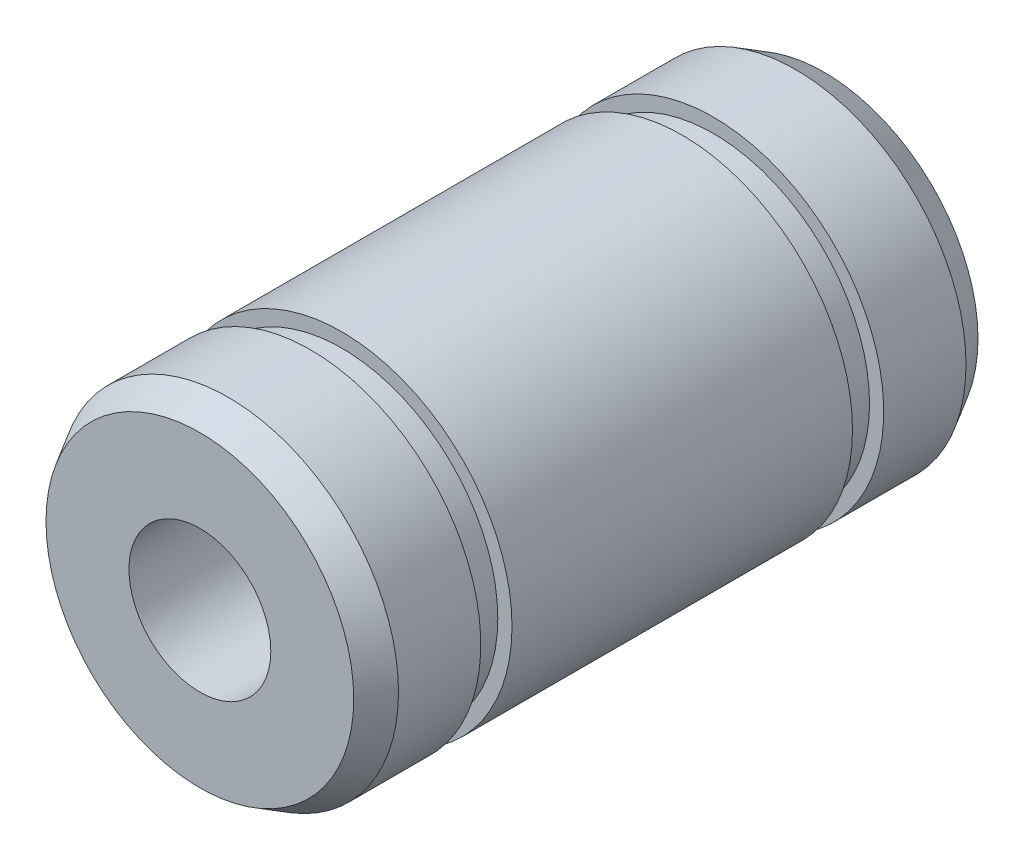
ISO-10303-21;
HEADER;
FILE_DESCRIPTION(('STEP AP214'),'2;1');
FILE_NAME('part.step','',(''),(''),'','','');
FILE_SCHEMA(('AUTOMOTIVE_DESIGN { 1 0 10303 214 1 1 1 1 }'));
ENDSEC;
DATA;
#1=APPLICATION_CONTEXT('core data for automotive mechanical design processes');
#2=APPLICATION_PROTOCOL_DEFINITION('international standard','automotive_design',2000,#1);
#3=PRODUCT_CONTEXT('',#1,'mechanical');
#4=PRODUCT('Part','Part','',(#3));
#5=PRODUCT_RELATED_PRODUCT_CATEGORY('part','',(#4));
#6=PRODUCT_DEFINITION_FORMATION('','',#4);
#7=PRODUCT_DEFINITION_CONTEXT('part definition',#1,'design');
#8=PRODUCT_DEFINITION('design','',#6,#7);
#9=PRODUCT_DEFINITION_SHAPE('','',#8);
#10=(LENGTH_UNIT() NAMED_UNIT(*) SI_UNIT(.MILLI.,.METRE.));
#11=(NAMED_UNIT(*) PLANE_ANGLE_UNIT() SI_UNIT($,.RADIAN.));
#12=(NAMED_UNIT(*) SI_UNIT($,.STERADIAN.) SOLID_ANGLE_UNIT());
#13=UNCERTAINTY_MEASURE_WITH_UNIT(LENGTH_MEASURE(1.E-05),#10,'distance_accuracy_value','');
#14=(GEOMETRIC_REPRESENTATION_CONTEXT(3) GLOBAL_UNCERTAINTY_ASSIGNED_CONTEXT((#13)) GLOBAL_UNIT_ASSIGNED_CONTEXT((#10,
#11,#12)) REPRESENTATION_CONTEXT('',''));
#15=CARTESIAN_POINT('',(0.,0.,0.));
#16=DIRECTION('',(0.,0.,1.));
#17=DIRECTION('',(1.,0.,0.));
#18=AXIS2_PLACEMENT_3D('',#15,#16,#17);
#19=CARTESIAN_POINT('',(0.,0.,11.));
#20=DIRECTION('',(0.,0.,-1.));
#21=DIRECTION('',(-1.,0.,0.));
#22=AXIS2_PLACEMENT_3D('',#19,#20,#21);
#23=CYLINDRICAL_SURFACE('',#22,6.);
#24=CARTESIAN_POINT('',(0.,0.,9.99999999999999));
#25=DIRECTION('',(0.,0.,1.));
#26=DIRECTION('',(1.,0.,0.));
#27=AXIS2_PLACEMENT_3D('',#24,#25,#26);
#28=CIRCLE('',#27,6.);
#29=CARTESIAN_POINT('',(6.,0.,9.99999999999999));
#30=VERTEX_POINT('',#29);
#31=EDGE_CURVE('E10',#30,#30,#28,.F.);
#32=ORIENTED_EDGE('',*,*,#31,.T.);
#33=EDGE_LOOP('',(#32));
#34=FACE_BOUND('',#33,.T.);
#35=CARTESIAN_POINT('',(0.,0.,7.1));
#36=DIRECTION('',(0.,0.,-1.));
#37=DIRECTION('',(-1.,0.,0.));
#38=AXIS2_PLACEMENT_3D('',#35,#36,#37);
#39=CIRCLE('',#38,6.);
#40=CARTESIAN_POINT('',(-6.,0.,7.1));
#41=VERTEX_POINT('',#40);
#42=EDGE_CURVE('E32',#41,#41,#39,.T.);
#43=ORIENTED_EDGE('',*,*,#42,.F.);
#44=EDGE_LOOP('',(#43));
#45=FACE_BOUND('',#44,.T.);
#46=ADVANCED_FACE('F29',(#34,#45),#23,.T.);
#47=CARTESIAN_POINT('',(0.,0.,6.));
#48=DIRECTION('',(0.,0.,1.));
#49=DIRECTION('',(1.,0.,0.));
#50=AXIS2_PLACEMENT_3D('',#47,#48,#49);
#51=CIRCLE('',#50,6.);
#52=CARTESIAN_POINT('',(6.,0.,6.));
#53=VERTEX_POINT('',#52);
#54=EDGE_CURVE('E44',#53,#53,#51,.T.);
#55=ORIENTED_EDGE('',*,*,#54,.F.);
#56=EDGE_LOOP('',(#55));
#57=FACE_BOUND('',#56,.T.);
#58=CARTESIAN_POINT('',(0.,0.,-6.));
#59=DIRECTION('',(0.,0.,1.));
#60=DIRECTION('',(1.,0.,0.));
#61=AXIS2_PLACEMENT_3D('',#58,#59,#60);
#62=CIRCLE('',#61,6.);
#63=CARTESIAN_POINT('',(6.,0.,-6.));
#64=VERTEX_POINT('',#63);
#65=EDGE_CURVE('E137',#64,#64,#62,.T.);
#66=ORIENTED_EDGE('',*,*,#65,.T.);
#67=EDGE_LOOP('',(#66));
#68=FACE_BOUND('',#67,.T.);
#69=ADVANCED_FACE('F67',(#57,#68),#23,.T.);
#70=CARTESIAN_POINT('',(0.,0.,11.));
#71=DIRECTION('',(0.,0.,1.));
#72=DIRECTION('',(1.,0.,0.));
#73=AXIS2_PLACEMENT_3D('',#70,#71,#72);
#74=PLANE('',#73);
#75=CARTESIAN_POINT('',(0.,0.,11.));
#76=DIRECTION('',(0.,0.,1.));
#77=DIRECTION('',(1.,0.,0.));
#78=AXIS2_PLACEMENT_3D('',#75,#76,#77);
#79=CIRCLE('',#78,5.42264973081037);
#80=CARTESIAN_POINT('',(5.42264973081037,0.,11.));
#81=VERTEX_POINT('',#80);
#82=EDGE_CURVE('E36',#81,#81,#79,.T.);
#83=ORIENTED_EDGE('',*,*,#82,.T.);
#84=EDGE_LOOP('',(#83));
#85=FACE_BOUND('',#84,.T.);
#86=CARTESIAN_POINT('',(0.,0.,11.));
#87=DIRECTION('',(0.,0.,1.));
#88=DIRECTION('',(1.,0.,0.));
#89=AXIS2_PLACEMENT_3D('',#86,#87,#88);
#90=CIRCLE('',#89,2.5);
#91=CARTESIAN_POINT('',(2.5,0.,11.));
#92=VERTEX_POINT('',#91);
#93=EDGE_CURVE('E41',#92,#92,#90,.T.);
#94=ORIENTED_EDGE('',*,*,#93,.F.);
#95=EDGE_LOOP('',(#94));
#96=FACE_BOUND('',#95,.T.);
#97=ADVANCED_FACE('F65',(#85,#96),#74,.T.);
#98=CARTESIAN_POINT('',(0.,0.,11.));
#99=DIRECTION('',(0.,0.,-1.));
#100=DIRECTION('',(-1.,0.,0.));
#101=AXIS2_PLACEMENT_3D('',#98,#99,#100);
#102=CYLINDRICAL_SURFACE('',#101,2.5);
#103=ORIENTED_EDGE('',*,*,#93,.T.);
#104=EDGE_LOOP('',(#103));
#105=FACE_BOUND('',#104,.T.);
#106=CARTESIAN_POINT('',(0.,0.,-11.));
#107=DIRECTION('',(0.,0.,1.));
#108=DIRECTION('',(1.,0.,0.));
#109=AXIS2_PLACEMENT_3D('',#106,#107,#108);
#110=CIRCLE('',#109,2.5);
#111=CARTESIAN_POINT('',(2.5,0.,-11.));
#112=VERTEX_POINT('',#111);
#113=EDGE_CURVE('E140',#112,#112,#110,.T.);
#114=ORIENTED_EDGE('',*,*,#113,.F.);
#115=EDGE_LOOP('',(#114));
#116=FACE_BOUND('',#115,.T.);
#117=ADVANCED_FACE('F62',(#105,#116),#102,.F.);
#118=CARTESIAN_POINT('',(0.,0.,11.));
#119=DIRECTION('',(0.,0.,-1.));
#120=DIRECTION('',(-1.,0.,0.));
#121=AXIS2_PLACEMENT_3D('',#118,#119,#120);
#122=CONICAL_SURFACE('',#121,5.42264973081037,0.523598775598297);
#123=ORIENTED_EDGE('',*,*,#31,.F.);
#124=EDGE_LOOP('',(#123));
#125=FACE_BOUND('',#124,.T.);
#126=ORIENTED_EDGE('',*,*,#82,.F.);
#127=EDGE_LOOP('',(#126));
#128=FACE_BOUND('',#127,.T.);
#129=ADVANCED_FACE('F75',(#125,#128),#122,.T.);
#130=CARTESIAN_POINT('',(0.,5.5,7.1));
#131=DIRECTION('',(0.,0.,-1.));
#132=DIRECTION('',(-1.,0.,0.));
#133=AXIS2_PLACEMENT_3D('',#130,#131,#132);
#134=PLANE('',#133);
#135=CARTESIAN_POINT('',(0.,0.,7.1));
#136=DIRECTION('',(0.,0.,1.));
#137=DIRECTION('',(1.,0.,0.));
#138=AXIS2_PLACEMENT_3D('',#135,#136,#137);
#139=CIRCLE('',#138,5.5);
#140=CARTESIAN_POINT('',(5.5,0.,7.1));
#141=VERTEX_POINT('',#140);
#142=EDGE_CURVE('E51',#141,#141,#139,.T.);
#143=ORIENTED_EDGE('',*,*,#142,.T.);
#144=EDGE_LOOP('',(#143));
#145=FACE_BOUND('',#144,.T.);
#146=ORIENTED_EDGE('',*,*,#42,.T.);
#147=EDGE_LOOP('',(#146));
#148=FACE_BOUND('',#147,.T.);
#149=ADVANCED_FACE('F88',(#145,#148),#134,.T.);
#150=CARTESIAN_POINT('',(0.,5.5,6.));
#151=DIRECTION('',(0.,0.,1.));
#152=DIRECTION('',(1.,0.,0.));
#153=AXIS2_PLACEMENT_3D('',#150,#151,#152);
#154=PLANE('',#153);
#155=CARTESIAN_POINT('',(0.,0.,6.));
#156=DIRECTION('',(0.,0.,1.));
#157=DIRECTION('',(1.,0.,0.));
#158=AXIS2_PLACEMENT_3D('',#155,#156,#157);
#159=CIRCLE('',#158,5.5);
#160=CARTESIAN_POINT('',(5.5,0.,6.));
#161=VERTEX_POINT('',#160);
#162=EDGE_CURVE('E46',#161,#161,#159,.T.);
#163=ORIENTED_EDGE('',*,*,#162,.F.);
#164=EDGE_LOOP('',(#163));
#165=FACE_BOUND('',#164,.T.);
#166=ORIENTED_EDGE('',*,*,#54,.T.);
#167=EDGE_LOOP('',(#166));
#168=FACE_BOUND('',#167,.T.);
#169=ADVANCED_FACE('F90',(#165,#168),#154,.T.);
#170=CARTESIAN_POINT('',(0.,0.,9.99999999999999));
#171=DIRECTION('',(0.,0.,1.));
#172=DIRECTION('',(1.,0.,0.));
#173=AXIS2_PLACEMENT_3D('',#170,#171,#172);
#174=CYLINDRICAL_SURFACE('',#173,5.5);
#175=ORIENTED_EDGE('',*,*,#162,.T.);
#176=EDGE_LOOP('',(#175));
#177=FACE_BOUND('',#176,.T.);
#178=ORIENTED_EDGE('',*,*,#142,.F.);
#179=EDGE_LOOP('',(#178));
#180=FACE_BOUND('',#179,.T.);
#181=ADVANCED_FACE('F97',(#177,#180),#174,.T.);
#182=CARTESIAN_POINT('',(0.,0.,-11.));
#183=DIRECTION('',(0.,0.,1.));
#184=DIRECTION('',(-1.,0.,0.));
#185=AXIS2_PLACEMENT_3D('',#182,#183,#184);
#186=CYLINDRICAL_SURFACE('',#185,6.);
#187=CARTESIAN_POINT('',(0.,0.,-9.99999999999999));
#188=DIRECTION('',(0.,0.,1.));
#189=DIRECTION('',(1.,0.,0.));
#190=AXIS2_PLACEMENT_3D('',#187,#188,#189);
#191=CIRCLE('',#190,6.);
#192=CARTESIAN_POINT('',(6.,0.,-9.99999999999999));
#193=VERTEX_POINT('',#192);
#194=EDGE_CURVE('E56',#193,#193,#191,.F.);
#195=ORIENTED_EDGE('',*,*,#194,.F.);
#196=EDGE_LOOP('',(#195));
#197=FACE_BOUND('',#196,.T.);
#198=CARTESIAN_POINT('',(0.,0.,-7.1));
#199=DIRECTION('',(0.,0.,-1.));
#200=DIRECTION('',(-1.,0.,0.));
#201=AXIS2_PLACEMENT_3D('',#198,#199,#200);
#202=CIRCLE('',#201,6.);
#203=CARTESIAN_POINT('',(-6.,0.,-7.1));
#204=VERTEX_POINT('',#203);
#205=EDGE_CURVE('E144',#204,#204,#202,.T.);
#206=ORIENTED_EDGE('',*,*,#205,.T.);
#207=EDGE_LOOP('',(#206));
#208=FACE_BOUND('',#207,.T.);
#209=ADVANCED_FACE('F104',(#197,#208),#186,.T.);
#210=CARTESIAN_POINT('',(0.,0.,-11.));
#211=DIRECTION('',(0.,0.,-1.));
#212=DIRECTION('',(1.,0.,0.));
#213=AXIS2_PLACEMENT_3D('',#210,#211,#212);
#214=PLANE('',#213);
#215=CARTESIAN_POINT('',(0.,0.,-11.));
#216=DIRECTION('',(0.,0.,1.));
#217=DIRECTION('',(1.,0.,0.));
#218=AXIS2_PLACEMENT_3D('',#215,#216,#217);
#219=CIRCLE('',#218,5.42264973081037);
#220=CARTESIAN_POINT('',(5.42264973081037,0.,-11.));
#221=VERTEX_POINT('',#220);
#222=EDGE_CURVE('E143',#221,#221,#219,.T.);
#223=ORIENTED_EDGE('',*,*,#222,.F.);
#224=EDGE_LOOP('',(#223));
#225=FACE_BOUND('',#224,.T.);
#226=ORIENTED_EDGE('',*,*,#113,.T.);
#227=EDGE_LOOP('',(#226));
#228=FACE_BOUND('',#227,.T.);
#229=ADVANCED_FACE('F107',(#225,#228),#214,.T.);
#230=CARTESIAN_POINT('',(0.,0.,-11.));
#231=DIRECTION('',(0.,0.,1.));
#232=DIRECTION('',(-1.,0.,0.));
#233=AXIS2_PLACEMENT_3D('',#230,#231,#232);
#234=CONICAL_SURFACE('',#233,5.42264973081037,0.523598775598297);
#235=ORIENTED_EDGE('',*,*,#194,.T.);
#236=EDGE_LOOP('',(#235));
#237=FACE_BOUND('',#236,.T.);
#238=ORIENTED_EDGE('',*,*,#222,.T.);
#239=EDGE_LOOP('',(#238));
#240=FACE_BOUND('',#239,.T.);
#241=ADVANCED_FACE('F111',(#237,#240),#234,.T.);
#242=CARTESIAN_POINT('',(0.,5.5,-7.1));
#243=DIRECTION('',(0.,0.,1.));
#244=DIRECTION('',(-1.,0.,0.));
#245=AXIS2_PLACEMENT_3D('',#242,#243,#244);
#246=PLANE('',#245);
#247=CARTESIAN_POINT('',(0.,0.,-7.1));
#248=DIRECTION('',(0.,0.,1.));
#249=DIRECTION('',(1.,0.,0.));
#250=AXIS2_PLACEMENT_3D('',#247,#248,#249);
#251=CIRCLE('',#250,5.5);
#252=CARTESIAN_POINT('',(5.5,0.,-7.1));
#253=VERTEX_POINT('',#252);
#254=EDGE_CURVE('E135',#253,#253,#251,.T.);
#255=ORIENTED_EDGE('',*,*,#254,.F.);
#256=EDGE_LOOP('',(#255));
#257=FACE_BOUND('',#256,.T.);
#258=ORIENTED_EDGE('',*,*,#205,.F.);
#259=EDGE_LOOP('',(#258));
#260=FACE_BOUND('',#259,.T.);
#261=ADVANCED_FACE('F115',(#257,#260),#246,.T.);
#262=CARTESIAN_POINT('',(0.,5.5,-6.));
#263=DIRECTION('',(0.,0.,-1.));
#264=DIRECTION('',(1.,0.,0.));
#265=AXIS2_PLACEMENT_3D('',#262,#263,#264);
#266=PLANE('',#265);
#267=CARTESIAN_POINT('',(0.,0.,-6.));
#268=DIRECTION('',(0.,0.,1.));
#269=DIRECTION('',(1.,0.,0.));
#270=AXIS2_PLACEMENT_3D('',#267,#268,#269);
#271=CIRCLE('',#270,5.5);
#272=CARTESIAN_POINT('',(5.5,0.,-6.));
#273=VERTEX_POINT('',#272);
#274=EDGE_CURVE('E132',#273,#273,#271,.T.);
#275=ORIENTED_EDGE('',*,*,#274,.T.);
#276=EDGE_LOOP('',(#275));
#277=FACE_BOUND('',#276,.T.);
#278=ORIENTED_EDGE('',*,*,#65,.F.);
#279=EDGE_LOOP('',(#278));
#280=FACE_BOUND('',#279,.T.);
#281=ADVANCED_FACE('F119',(#277,#280),#266,.T.);
#282=CARTESIAN_POINT('',(0.,0.,-9.99999999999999));
#283=DIRECTION('',(0.,0.,-1.));
#284=DIRECTION('',(1.,0.,0.));
#285=AXIS2_PLACEMENT_3D('',#282,#283,#284);
#286=CYLINDRICAL_SURFACE('',#285,5.5);
#287=ORIENTED_EDGE('',*,*,#274,.F.);
#288=EDGE_LOOP('',(#287));
#289=FACE_BOUND('',#288,.T.);
#290=ORIENTED_EDGE('',*,*,#254,.T.);
#291=EDGE_LOOP('',(#290));
#292=FACE_BOUND('',#291,.T.);
#293=ADVANCED_FACE('F123',(#289,#292),#286,.T.);
#294=CLOSED_SHELL('',(#46,#69,#97,#117,#129,#149,#169,#181,#209,#229,#241,#261,#281,#293));
#295=MANIFOLD_SOLID_BREP('B2',#294);
#296=ADVANCED_BREP_SHAPE_REPRESENTATION('',(#18,#295),#14);
#297=SHAPE_DEFINITION_REPRESENTATION(#9,#296);
ENDSEC;
END-ISO-10303-21;
